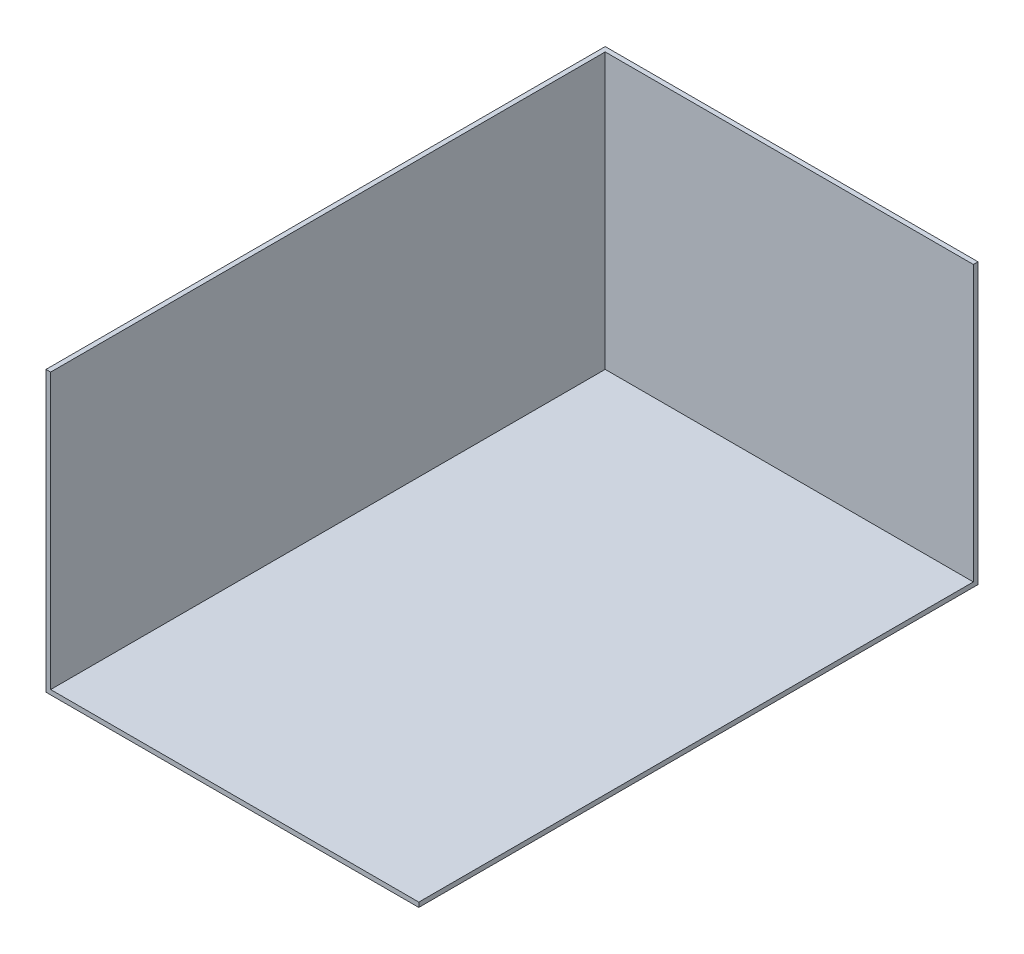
from build123d import *

# Parameters (mm, degrees)
SKETCH1_W           = 508
SKETCH1_H           = 762
BOSS_EXTRUDE1_DEPTH = 381
SHELL1_T            = -6.35


with BuildPart() as part:
    # Sketch1 → Boss-Extrude1 (new body)
    with BuildSketch(Plane(origin=(0, 0, 0), x_dir=(1, 0, 0), z_dir=(0, 1, 0))):
        Rectangle(SKETCH1_W, SKETCH1_H)
    extrude(amount=BOSS_EXTRUDE1_DEPTH)

    # Shell1
    shell1_openings = [part.faces().sort_by_distance(p)[0] for p in [
        (0, 381, 0),
        (254, 190.5, 0),
        (0, 190.5, 381),
    ]]
    offset(amount=SHELL1_T, openings=shell1_openings, kind=Kind.INTERSECTION)


solid = part.part
